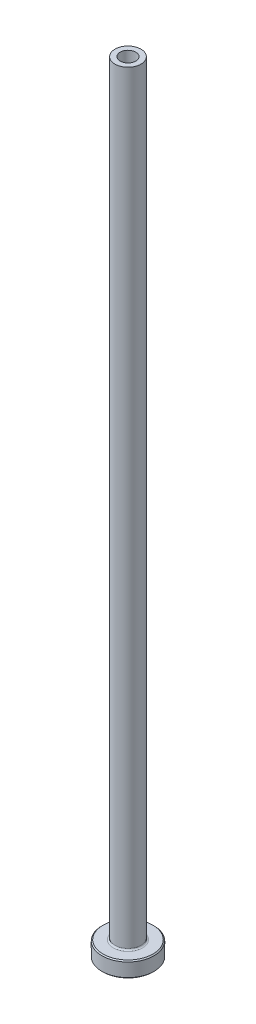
from build123d import *

# Parameters (mm, degrees)
FILLET1_R     = 0.3
CHAMFER1_SIZE = 0.2
CHAMFER3_SIZE = 0.5


with BuildPart() as part:
    # Sketch1 → Revolve1 (revolve)
    with BuildSketch(Plane.XY, mode=Mode.PRIVATE) as revolve1_sk:
        Polygon((-1.5, 150), (-2.5, 150), (-2.5, 3), (-5, 3), (-5, 0), (-1.75, 0), (-1.75, 93), (-1.5, 105), align=None)
    revolve(revolve1_sk.sketch.rotate(Axis((0, 92.187680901, 0), (0, -1, 0)), 270), axis=Axis((0, 92.187680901, 0), (0, -1, 0)))

    # Fillet1
    fillet1_edges = [part.edges().sort_by_distance(p)[0] for p in [
        (0, 3, -2.5),
    ]]
    fillet(fillet1_edges, radius=FILLET1_R)

    # Chamfer1
    chamfer1_edges = [part.edges().sort_by_distance(p)[0] for p in [
        (0, 0, -5),
        (0, 3, -5),
    ]]
    chamfer(chamfer1_edges, length=CHAMFER1_SIZE)

    # Chamfer3
    chamfer3_edges = [part.edges().sort_by_distance(p)[0] for p in [
        (0, 0, -1.75),
    ]]
    chamfer(chamfer3_edges, length=CHAMFER3_SIZE)


solid = part.part
